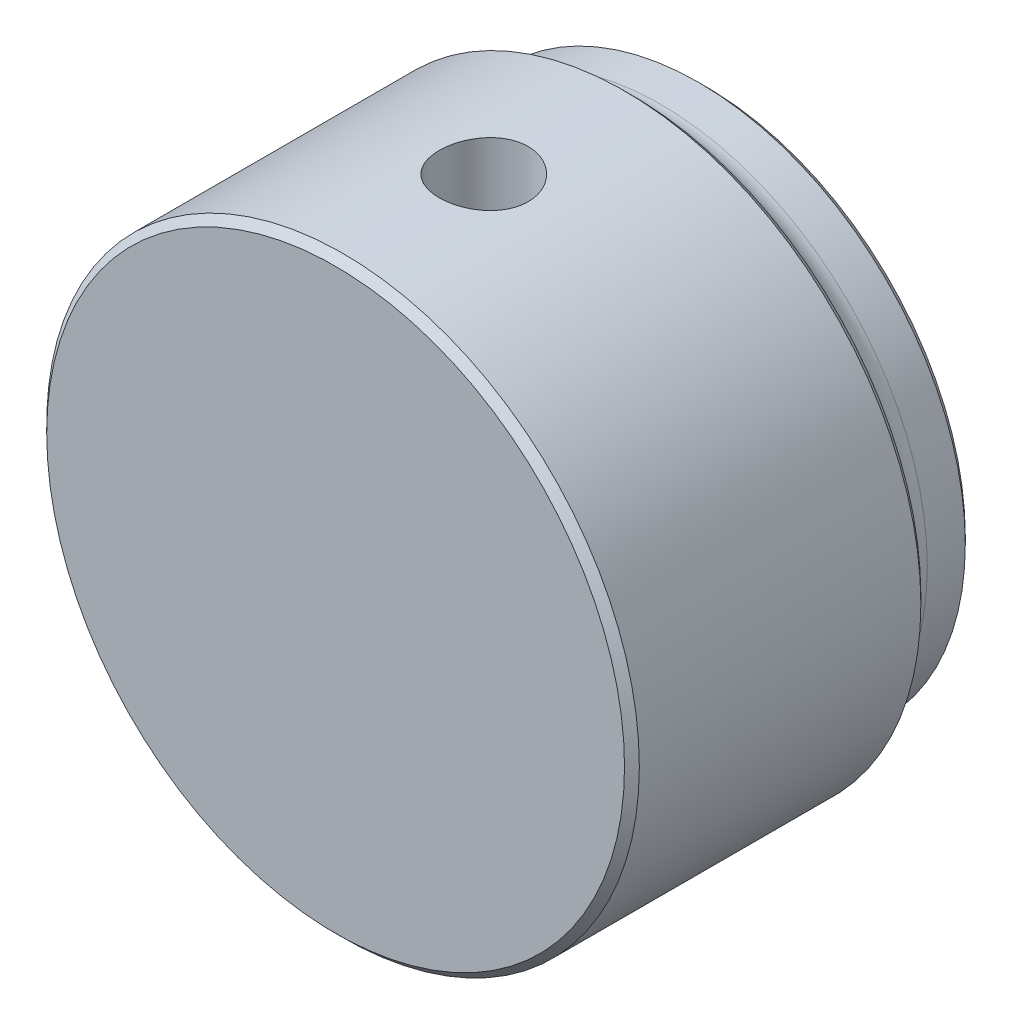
ISO-10303-21;
HEADER;
FILE_DESCRIPTION(('STEP AP214'),'2;1');
FILE_NAME('part.step','',(''),(''),'','','');
FILE_SCHEMA(('AUTOMOTIVE_DESIGN { 1 0 10303 214 1 1 1 1 }'));
ENDSEC;
DATA;
#1=APPLICATION_CONTEXT('core data for automotive mechanical design processes');
#2=APPLICATION_PROTOCOL_DEFINITION('international standard','automotive_design',2000,#1);
#3=PRODUCT_CONTEXT('',#1,'mechanical');
#4=PRODUCT('Part','Part','',(#3));
#5=PRODUCT_RELATED_PRODUCT_CATEGORY('part','',(#4));
#6=PRODUCT_DEFINITION_FORMATION('','',#4);
#7=PRODUCT_DEFINITION_CONTEXT('part definition',#1,'design');
#8=PRODUCT_DEFINITION('design','',#6,#7);
#9=PRODUCT_DEFINITION_SHAPE('','',#8);
#10=(LENGTH_UNIT() NAMED_UNIT(*) SI_UNIT(.MILLI.,.METRE.));
#11=(NAMED_UNIT(*) PLANE_ANGLE_UNIT() SI_UNIT($,.RADIAN.));
#12=(NAMED_UNIT(*) SI_UNIT($,.STERADIAN.) SOLID_ANGLE_UNIT());
#13=UNCERTAINTY_MEASURE_WITH_UNIT(LENGTH_MEASURE(1.E-05),#10,'distance_accuracy_value','');
#14=(GEOMETRIC_REPRESENTATION_CONTEXT(3) GLOBAL_UNCERTAINTY_ASSIGNED_CONTEXT((#13)) GLOBAL_UNIT_ASSIGNED_CONTEXT((#10,
#11,#12)) REPRESENTATION_CONTEXT('',''));
#15=CARTESIAN_POINT('',(0.,0.,0.));
#16=DIRECTION('',(0.,0.,1.));
#17=DIRECTION('',(1.,0.,0.));
#18=AXIS2_PLACEMENT_3D('',#15,#16,#17);
#19=CARTESIAN_POINT('',(0.,6.59194920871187E-13,50.8));
#20=DIRECTION('',(0.,0.,-1.));
#21=DIRECTION('',(-1.,0.,0.));
#22=AXIS2_PLACEMENT_3D('',#19,#20,#21);
#23=CYLINDRICAL_SURFACE('',#22,50.8);
#24=CARTESIAN_POINT('',(0.,-50.7999999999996,33.0199999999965));
#25=CARTESIAN_POINT('',(0.212802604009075,-50.8000011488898,33.0200029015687));
#26=CARTESIAN_POINT('',(0.425564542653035,-50.7986602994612,33.0110826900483));
#27=CARTESIAN_POINT('',(0.849629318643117,-50.7933368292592,32.9754732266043));
#28=CARTESIAN_POINT('',(1.06093183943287,-50.7893536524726,32.9487802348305));
#29=CARTESIAN_POINT('',(1.48063776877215,-50.7788521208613,32.8777970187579));
#30=CARTESIAN_POINT('',(1.68903910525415,-50.7723320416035,32.8334948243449));
#31=CARTESIAN_POINT('',(2.10139753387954,-50.7569375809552,32.7276091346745));
#32=CARTESIAN_POINT('',(2.30535296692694,-50.7480623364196,32.6660193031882));
#33=CARTESIAN_POINT('',(2.70707306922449,-50.7282185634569,32.5261030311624));
#34=CARTESIAN_POINT('',(2.90484449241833,-50.7172524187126,32.4477956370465));
#35=CARTESIAN_POINT('',(3.29313395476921,-50.6935214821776,32.2749434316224));
#36=CARTESIAN_POINT('',(3.48364928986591,-50.6807560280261,32.1803926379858));
#37=CARTESIAN_POINT('',(3.85593885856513,-50.6537911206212,31.9758061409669));
#38=CARTESIAN_POINT('',(4.0377175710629,-50.6395924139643,31.8657784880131));
#39=CARTESIAN_POINT('',(4.39146308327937,-50.6101429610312,31.6309342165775));
#40=CARTESIAN_POINT('',(4.563426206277,-50.5948918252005,31.5061121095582));
#41=CARTESIAN_POINT('',(4.89740038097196,-50.5636607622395,31.2417061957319));
#42=CARTESIAN_POINT('',(5.0593380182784,-50.5476766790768,31.1020301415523));
#43=CARTESIAN_POINT('',(5.37095361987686,-50.5155165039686,30.8095231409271));
#44=CARTESIAN_POINT('',(5.52062702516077,-50.4993403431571,30.6566873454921));
#45=CARTESIAN_POINT('',(5.80659328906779,-50.4672584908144,30.3389823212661));
#46=CARTESIAN_POINT('',(5.94288791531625,-50.4513527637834,30.1741146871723));
#47=CARTESIAN_POINT('',(6.2011696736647,-50.4202580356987,29.8334618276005));
#48=CARTESIAN_POINT('',(6.32315660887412,-50.40506904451,29.6576764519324));
#49=CARTESIAN_POINT('',(6.55252243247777,-50.3757668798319,29.295512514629));
#50=CARTESIAN_POINT('',(6.65982643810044,-50.3616593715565,29.1090860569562));
#51=CARTESIAN_POINT('',(6.85833669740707,-50.3350102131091,28.7277360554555));
#52=CARTESIAN_POINT('',(6.9495425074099,-50.3224686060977,28.5328122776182));
#53=CARTESIAN_POINT('',(7.11516001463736,-50.2993190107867,28.1358965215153));
#54=CARTESIAN_POINT('',(7.18957556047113,-50.2887105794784,27.9339061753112));
#55=CARTESIAN_POINT('',(7.32110212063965,-50.2697313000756,27.5241871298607));
#56=CARTESIAN_POINT('',(7.3782071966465,-50.2613612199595,27.3164564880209));
#57=CARTESIAN_POINT('',(7.47427136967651,-50.2471651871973,26.8984348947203));
#58=CARTESIAN_POINT('',(7.51336624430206,-50.241320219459,26.6881757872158));
#59=CARTESIAN_POINT('',(7.57375361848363,-50.2322524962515,26.2650576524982));
#60=CARTESIAN_POINT('',(7.5950459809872,-50.2290297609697,26.0521986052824));
#61=CARTESIAN_POINT('',(7.61966268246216,-50.2253013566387,25.625434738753));
#62=CARTESIAN_POINT('',(7.62298824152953,-50.2247955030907,25.4115299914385));
#63=CARTESIAN_POINT('',(7.61164893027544,-50.2265152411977,24.98420494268));
#64=CARTESIAN_POINT('',(7.59698374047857,-50.2287408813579,24.7707846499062));
#65=CARTESIAN_POINT('',(7.54997571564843,-50.2358280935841,24.3477806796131));
#66=CARTESIAN_POINT('',(7.51778404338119,-50.2406671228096,24.1381798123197));
#67=CARTESIAN_POINT('',(7.43605660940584,-50.2528284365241,23.7223900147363));
#68=CARTESIAN_POINT('',(7.38651490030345,-50.2601515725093,23.5162022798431));
#69=CARTESIAN_POINT('',(7.27046691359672,-50.2770698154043,23.1088145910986));
#70=CARTESIAN_POINT('',(7.20396637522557,-50.2866641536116,22.9076129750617));
#71=CARTESIAN_POINT('',(7.05449582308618,-50.3078498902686,22.511508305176));
#72=CARTESIAN_POINT('',(6.97151969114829,-50.319442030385,22.3166076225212));
#73=CARTESIAN_POINT('',(6.6980451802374,-50.3568298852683,21.7420594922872));
#74=CARTESIAN_POINT('',(6.48333803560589,-50.3851852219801,21.3737466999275));
#75=CARTESIAN_POINT('',(5.99592211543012,-50.4455048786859,20.6783583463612));
#76=CARTESIAN_POINT('',(5.72320953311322,-50.4774694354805,20.3512854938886));
#77=CARTESIAN_POINT('',(5.12417646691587,-50.5418070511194,19.7439570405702));
#78=CARTESIAN_POINT('',(4.79734706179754,-50.5741809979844,19.4642024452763));
#79=CARTESIAN_POINT('',(4.10111834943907,-50.6353902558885,18.963452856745));
#80=CARTESIAN_POINT('',(3.73171885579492,-50.6642255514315,18.7424581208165));
#81=CARTESIAN_POINT('',(2.96039380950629,-50.7151393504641,18.3654555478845));
#82=CARTESIAN_POINT('',(2.5584490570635,-50.7372138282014,18.2094864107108));
#83=CARTESIAN_POINT('',(1.73366763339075,-50.7720849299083,17.9674039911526));
#84=CARTESIAN_POINT('',(1.31083237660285,-50.784882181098,17.8812859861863));
#85=CARTESIAN_POINT('',(0.460601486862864,-50.799673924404,17.782015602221));
#86=CARTESIAN_POINT('',(0.033288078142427,-50.8017705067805,17.7681736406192));
#87=CARTESIAN_POINT('',(-0.817558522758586,-50.7952024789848,17.8120195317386));
#88=CARTESIAN_POINT('',(-1.24109183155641,-50.7865382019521,17.8697051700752));
#89=CARTESIAN_POINT('',(-2.07026381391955,-50.759485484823,18.0543905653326));
#90=CARTESIAN_POINT('',(-2.47597900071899,-50.7411441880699,18.1810543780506));
#91=CARTESIAN_POINT('',(-3.26042264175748,-50.6967860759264,18.4997637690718));
#92=CARTESIAN_POINT('',(-3.63914982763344,-50.6707689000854,18.691812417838));
#93=CARTESIAN_POINT('',(-4.36185572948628,-50.6137013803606,19.1373926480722));
#94=CARTESIAN_POINT('',(-4.70556165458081,-50.5826158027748,19.3913612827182));
#95=CARTESIAN_POINT('',(-5.34584157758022,-50.5189632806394,19.953207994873));
#96=CARTESIAN_POINT('',(-5.64241283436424,-50.4863962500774,20.2610892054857));
#97=CARTESIAN_POINT('',(-6.04661896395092,-50.4390433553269,20.7578966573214));
#98=CARTESIAN_POINT('',(-6.1750783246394,-50.4234399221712,20.9302108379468));
#99=CARTESIAN_POINT('',(-6.41701721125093,-50.3932210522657,21.2851091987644));
#100=CARTESIAN_POINT('',(-6.53050225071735,-50.3786052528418,21.4676895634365));
#101=CARTESIAN_POINT('',(-6.74171125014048,-50.350776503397,21.8419200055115));
#102=CARTESIAN_POINT('',(-6.8394297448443,-50.3375640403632,22.0335731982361));
#103=CARTESIAN_POINT('',(-7.01832473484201,-50.3129334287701,22.4244838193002));
#104=CARTESIAN_POINT('',(-7.09950714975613,-50.3015146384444,22.6237384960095));
#105=CARTESIAN_POINT('',(-7.2445197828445,-50.2808341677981,23.0278159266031));
#106=CARTESIAN_POINT('',(-7.30840738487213,-50.2715653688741,23.2326177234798));
#107=CARTESIAN_POINT('',(-7.41870741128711,-50.2554065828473,23.6469626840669));
#108=CARTESIAN_POINT('',(-7.46512024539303,-50.2485165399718,23.8565057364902));
#109=CARTESIAN_POINT('',(-7.5401156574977,-50.2373177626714,24.2788187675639));
#110=CARTESIAN_POINT('',(-7.56869893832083,-50.233008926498,24.4915886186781));
#111=CARTESIAN_POINT('',(-7.60781650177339,-50.2270994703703,24.9188146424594));
#112=CARTESIAN_POINT('',(-7.61835119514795,-50.2254987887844,25.1332707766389));
#113=CARTESIAN_POINT('',(-7.62127653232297,-50.2250549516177,25.5601871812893));
#114=CARTESIAN_POINT('',(-7.61384552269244,-50.2261846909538,25.7726462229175));
#115=CARTESIAN_POINT('',(-7.58127347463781,-50.2311115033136,26.1960961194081));
#116=CARTESIAN_POINT('',(-7.55613866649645,-50.2349076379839,26.4070874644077));
#117=CARTESIAN_POINT('',(-7.48835044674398,-50.245057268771,26.8262122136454));
#118=CARTESIAN_POINT('',(-7.44569390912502,-50.2514112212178,27.0343451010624));
#119=CARTESIAN_POINT('',(-7.34318383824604,-50.2664931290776,27.4462384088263));
#120=CARTESIAN_POINT('',(-7.28333065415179,-50.275221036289,27.6499989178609));
#121=CARTESIAN_POINT('',(-7.14692224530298,-50.294793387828,28.0515723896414));
#122=CARTESIAN_POINT('',(-7.07037965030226,-50.3056362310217,28.2493897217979));
#123=CARTESIAN_POINT('',(-6.90112404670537,-50.3291345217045,28.6378661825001));
#124=CARTESIAN_POINT('',(-6.808411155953,-50.3417899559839,28.8285253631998));
#125=CARTESIAN_POINT('',(-6.60745654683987,-50.3685595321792,29.2014188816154));
#126=CARTESIAN_POINT('',(-6.49921163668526,-50.3826739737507,29.3836514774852));
#127=CARTESIAN_POINT('',(-6.26800941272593,-50.4119591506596,29.7383474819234));
#128=CARTESIAN_POINT('',(-6.1450573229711,-50.427129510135,29.910814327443));
#129=CARTESIAN_POINT('',(-5.88396012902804,-50.4582645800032,30.2465540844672));
#130=CARTESIAN_POINT('',(-5.74567547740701,-50.4742357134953,30.4097178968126));
#131=CARTESIAN_POINT('',(-5.45594902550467,-50.5063743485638,30.7237814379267));
#132=CARTESIAN_POINT('',(-5.30451197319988,-50.52254177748,30.8746855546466));
#133=CARTESIAN_POINT('',(-4.98938852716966,-50.5546347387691,31.1633397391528));
#134=CARTESIAN_POINT('',(-4.82569484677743,-50.5705601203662,31.3010818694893));
#135=CARTESIAN_POINT('',(-4.48732930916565,-50.6017067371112,31.562299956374));
#136=CARTESIAN_POINT('',(-4.31266152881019,-50.6169282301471,31.6857811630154));
#137=CARTESIAN_POINT('',(-3.95243779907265,-50.6463332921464,31.9183484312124));
#138=CARTESIAN_POINT('',(-3.76682375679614,-50.660510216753,32.0273453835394));
#139=CARTESIAN_POINT('',(-3.38702550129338,-50.6873187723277,32.2292530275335));
#140=CARTESIAN_POINT('',(-3.19284447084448,-50.6999509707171,32.3221696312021));
#141=CARTESIAN_POINT('',(-2.79736008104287,-50.7233079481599,32.491218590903));
#142=CARTESIAN_POINT('',(-2.59606205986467,-50.7340341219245,32.5673632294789));
#143=CARTESIAN_POINT('',(-2.18771873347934,-50.7532825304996,32.7023652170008));
#144=CARTESIAN_POINT('',(-1.98067472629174,-50.7618052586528,32.7612264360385));
#145=CARTESIAN_POINT('',(-1.48178638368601,-50.7792098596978,32.8804636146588));
#146=CARTESIAN_POINT('',(-1.18792642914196,-50.7869714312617,32.9327313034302));
#147=CARTESIAN_POINT('',(-0.596017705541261,-50.7973656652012,33.0024972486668));
#148=CARTESIAN_POINT('',(-0.297968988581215,-50.7999983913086,33.0199959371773));
#149=CARTESIAN_POINT('',(0.,-50.7999999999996,33.0199999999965));
#150=B_SPLINE_CURVE_WITH_KNOTS('',3,(#24,#25,#26,#27,#28,#29,#30,#31,#32,#33,#34,#35,#36,#37,
#38,#39,#40,#41,#42,#43,#44,#45,#46,#47,#48,#49,#50,#51,#52,#53,#54,#55,#56,#57,#58,#59,#60,#61,
#62,#63,#64,#65,#66,#67,#68,#69,#70,#71,#72,#73,#74,#75,#76,#77,#78,#79,#80,#81,#82,#83,#84,#85,
#86,#87,#88,#89,#90,#91,#92,#93,#94,#95,#96,#97,#98,#99,#100,#101,#102,#103,#104,#105,#106,#107,
#108,#109,#110,#111,#112,#113,#114,#115,#116,#117,#118,#119,#120,#121,#122,#123,#124,#125,#126,
#127,#128,#129,#130,#131,#132,#133,#134,#135,#136,#137,#138,#139,#140,#141,#142,#143,#144,#145,
#146,#147,#148,#149),.UNSPECIFIED.,.T.,.F.,(4,2,2,2,2,2,2,2,2,2,2,2,2,2,2,2,2,2,2,2,2,2,2,2,2,2,
2,2,2,2,2,2,2,2,2,2,2,2,2,2,2,2,2,2,2,2,2,2,2,2,2,2,2,2,2,2,2,2,2,2,2,2,4),(0.,
0.638146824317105,1.27642797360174,1.91514374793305,2.55409392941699,3.19231999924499,
3.83078162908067,4.4689123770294,5.10728060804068,5.74987460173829,6.39270639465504,
7.03545314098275,7.67820873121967,8.32412904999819,8.97006716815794,9.61585707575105,
10.2618682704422,10.9029261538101,11.5439889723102,12.1850082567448,12.8260389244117,
13.4616264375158,14.0974320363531,14.7330227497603,15.3688499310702,16.6441456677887,
17.9195251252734,19.2076613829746,20.4958032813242,21.7847107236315,23.0735310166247,
24.350031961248,25.6264933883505,26.89679295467,28.1671521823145,29.4467517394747,
30.7264256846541,31.3722744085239,32.0178846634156,32.6637182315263,33.3093201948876,
33.9527530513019,34.5961708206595,35.239563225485,35.8829409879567,36.5199581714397,
37.1567512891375,37.793658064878,38.4305519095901,39.0669654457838,39.7033743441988,
40.3399142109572,40.9762286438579,41.6189018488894,42.2613440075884,42.9041711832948,
43.5467609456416,44.1931371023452,44.8392751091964,45.4849383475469,46.1304568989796,
47.0240095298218,47.9175510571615),.UNSPECIFIED.);
#151=CARTESIAN_POINT('',(0.,-50.7999999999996,33.0199999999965));
#152=VERTEX_POINT('',#151);
#153=EDGE_CURVE('E79',#152,#152,#150,.T.);
#154=ORIENTED_EDGE('',*,*,#153,.T.);
#155=EDGE_LOOP('',(#154));
#156=FACE_BOUND('',#155,.T.);
#157=CARTESIAN_POINT('',(0.,50.8,33.0199999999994));
#158=CARTESIAN_POINT('',(-0.212802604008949,50.8000011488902,33.0200029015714));
#159=CARTESIAN_POINT('',(-0.425564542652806,50.798660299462,33.0110826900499));
#160=CARTESIAN_POINT('',(-0.849629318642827,50.7933368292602,32.9754732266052));
#161=CARTESIAN_POINT('',(-1.06093183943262,50.7893536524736,32.9487802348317));
#162=CARTESIAN_POINT('',(-1.48063776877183,50.7788521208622,32.8777970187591));
#163=CARTESIAN_POINT('',(-1.68903910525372,50.7723320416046,32.8334948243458));
#164=CARTESIAN_POINT('',(-2.10139753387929,50.7569375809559,32.7276091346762));
#165=CARTESIAN_POINT('',(-2.30535296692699,50.74806233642,32.666019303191));
#166=CARTESIAN_POINT('',(-2.70707306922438,50.7282185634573,32.5261030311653));
#167=CARTESIAN_POINT('',(-2.90484449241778,50.7172524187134,32.4477956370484));
#168=CARTESIAN_POINT('',(-3.29313395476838,50.6935214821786,32.2749434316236));
#169=CARTESIAN_POINT('',(-3.48364928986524,50.6807560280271,32.1803926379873));
#170=CARTESIAN_POINT('',(-3.85593885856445,50.6537911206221,31.9758061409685));
#171=CARTESIAN_POINT('',(-4.03771757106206,50.6395924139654,31.8657784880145));
#172=CARTESIAN_POINT('',(-4.39146308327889,50.610142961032,31.6309342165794));
#173=CARTESIAN_POINT('',(-4.56342620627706,50.5948918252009,31.5061121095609));
#174=CARTESIAN_POINT('',(-4.89740038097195,50.5636607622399,31.2417061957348));
#175=CARTESIAN_POINT('',(-5.05933801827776,50.5476766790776,31.1020301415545));
#176=CARTESIAN_POINT('',(-5.37095361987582,50.5155165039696,30.8095231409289));
#177=CARTESIAN_POINT('',(-5.52062702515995,50.499340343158,30.6566873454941));
#178=CARTESIAN_POINT('',(-5.806593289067,50.4672584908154,30.3389823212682));
#179=CARTESIAN_POINT('',(-5.94288791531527,50.4513527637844,30.1741146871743));
#180=CARTESIAN_POINT('',(-6.20116967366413,50.4202580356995,29.8334618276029));
#181=CARTESIAN_POINT('',(-6.32315660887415,50.4050690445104,29.6576764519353));
#182=CARTESIAN_POINT('',(-6.55252243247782,50.3757668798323,29.2955125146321));
#183=CARTESIAN_POINT('',(-6.65982643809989,50.3616593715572,29.1090860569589));
#184=CARTESIAN_POINT('',(-6.85833669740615,50.3350102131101,28.727736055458));
#185=CARTESIAN_POINT('',(-6.94954250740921,50.3224686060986,28.5328122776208));
#186=CARTESIAN_POINT('',(-7.11516001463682,50.2993190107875,28.135896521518));
#187=CARTESIAN_POINT('',(-7.1895755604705,50.2887105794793,27.9339061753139));
#188=CARTESIAN_POINT('',(-7.32110212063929,50.2697313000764,27.5241871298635));
#189=CARTESIAN_POINT('',(-7.37820719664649,50.2613612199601,27.3164564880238));
#190=CARTESIAN_POINT('',(-7.47427136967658,50.2471651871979,26.8984348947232));
#191=CARTESIAN_POINT('',(-7.51336624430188,50.2413202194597,26.6881757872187));
#192=CARTESIAN_POINT('',(-7.57375361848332,50.2322524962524,26.2650576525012));
#193=CARTESIAN_POINT('',(-7.595045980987,50.2290297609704,26.0521986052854));
#194=CARTESIAN_POINT('',(-7.61966268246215,50.2253013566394,25.625434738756));
#195=CARTESIAN_POINT('',(-7.62298824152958,50.2247955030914,25.4115299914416));
#196=CARTESIAN_POINT('',(-7.61164893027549,50.2265152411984,24.9842049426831));
#197=CARTESIAN_POINT('',(-7.59698374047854,50.2287408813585,24.7707846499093));
#198=CARTESIAN_POINT('',(-7.54997571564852,50.2358280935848,24.3477806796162));
#199=CARTESIAN_POINT('',(-7.51778404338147,50.2406671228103,24.1381798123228));
#200=CARTESIAN_POINT('',(-7.43605660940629,50.2528284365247,23.7223900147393));
#201=CARTESIAN_POINT('',(-7.38651490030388,50.2601515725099,23.5162022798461));
#202=CARTESIAN_POINT('',(-7.2704669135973,50.2770698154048,23.1088145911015));
#203=CARTESIAN_POINT('',(-7.20396637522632,50.2866641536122,22.9076129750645));
#204=CARTESIAN_POINT('',(-7.05449582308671,50.3078498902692,22.5115083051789));
#205=CARTESIAN_POINT('',(-6.97151969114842,50.3194420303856,22.3166076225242));
#206=CARTESIAN_POINT('',(-6.69804518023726,50.3568298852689,21.7420594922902));
#207=CARTESIAN_POINT('',(-6.48333803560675,50.3851852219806,21.3737466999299));
#208=CARTESIAN_POINT('',(-5.99592211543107,50.4455048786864,20.6783583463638));
#209=CARTESIAN_POINT('',(-5.72320953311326,50.4774694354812,20.3512854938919));
#210=CARTESIAN_POINT('',(-5.12417646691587,50.54180705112,19.7439570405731));
#211=CARTESIAN_POINT('',(-4.79734706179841,50.5741809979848,19.4642024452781));
#212=CARTESIAN_POINT('',(-4.10111834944,50.6353902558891,18.9634528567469));
#213=CARTESIAN_POINT('',(-3.73171885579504,50.6642255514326,18.7424581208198));
#214=CARTESIAN_POINT('',(-2.96039380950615,50.7151393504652,18.3654555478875));
#215=CARTESIAN_POINT('',(-2.55844905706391,50.7372138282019,18.2094864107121));
#216=CARTESIAN_POINT('',(-1.73366763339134,50.7720849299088,17.967403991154));
#217=CARTESIAN_POINT('',(-1.31083237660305,50.7848821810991,17.8812859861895));
#218=CARTESIAN_POINT('',(-0.460601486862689,50.7996739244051,17.782015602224));
#219=CARTESIAN_POINT('',(-0.0332880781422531,50.8017705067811,17.7681736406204));
#220=CARTESIAN_POINT('',(0.817558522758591,50.7952024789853,17.8120195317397));
#221=CARTESIAN_POINT('',(1.24109183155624,50.7865382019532,17.8697051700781));
#222=CARTESIAN_POINT('',(2.07026381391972,50.759485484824,18.0543905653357));
#223=CARTESIAN_POINT('',(2.47597900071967,50.7411441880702,18.181054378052));
#224=CARTESIAN_POINT('',(3.260422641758,50.6967860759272,18.4997637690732));
#225=CARTESIAN_POINT('',(3.6391498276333,50.6707689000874,18.691812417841));
#226=CARTESIAN_POINT('',(4.36185572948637,50.6137013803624,19.1373926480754));
#227=CARTESIAN_POINT('',(4.70556165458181,50.5826158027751,19.3913612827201));
#228=CARTESIAN_POINT('',(5.34584157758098,50.5189632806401,19.953207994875));
#229=CARTESIAN_POINT('',(5.64241283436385,50.4863962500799,20.2610892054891));
#230=CARTESIAN_POINT('',(6.04661896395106,50.4390433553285,20.7578966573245));
#231=CARTESIAN_POINT('',(6.17507832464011,50.423439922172,20.9302108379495));
#232=CARTESIAN_POINT('',(6.41701721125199,50.3932210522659,21.2851091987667));
#233=CARTESIAN_POINT('',(6.53050225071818,50.3786052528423,21.467689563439));
#234=CARTESIAN_POINT('',(6.74171125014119,50.3507765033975,21.8419200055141));
#235=CARTESIAN_POINT('',(6.83942974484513,50.3375640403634,22.0335731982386));
#236=CARTESIAN_POINT('',(7.01832473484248,50.312933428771,22.4244838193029));
#237=CARTESIAN_POINT('',(7.09950714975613,50.3015146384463,22.6237384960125));
#238=CARTESIAN_POINT('',(7.24451978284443,50.2808341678,23.0278159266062));
#239=CARTESIAN_POINT('',(7.30840738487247,50.2715653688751,23.2326177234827));
#240=CARTESIAN_POINT('',(7.41870741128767,50.2554065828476,23.6469626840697));
#241=CARTESIAN_POINT('',(7.46512024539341,50.2485165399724,23.8565057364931));
#242=CARTESIAN_POINT('',(7.54011565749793,50.237317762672,24.2788187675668));
#243=CARTESIAN_POINT('',(7.56869893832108,50.2330089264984,24.491588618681));
#244=CARTESIAN_POINT('',(7.60781650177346,50.2270994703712,24.9188146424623));
#245=CARTESIAN_POINT('',(7.61835119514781,50.2254987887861,25.1332707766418));
#246=CARTESIAN_POINT('',(7.62127653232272,50.2250549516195,25.5601871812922));
#247=CARTESIAN_POINT('',(7.61384552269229,50.2261846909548,25.7726462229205));
#248=CARTESIAN_POINT('',(7.58127347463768,50.2311115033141,26.1960961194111));
#249=CARTESIAN_POINT('',(7.55613866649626,50.2349076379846,26.4070874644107));
#250=CARTESIAN_POINT('',(7.48835044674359,50.2450572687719,26.8262122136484));
#251=CARTESIAN_POINT('',(7.44569390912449,50.2514112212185,27.0343451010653));
#252=CARTESIAN_POINT('',(7.34318383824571,50.2664931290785,27.4462384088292));
#253=CARTESIAN_POINT('',(7.2833306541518,50.2752210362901,27.649998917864));
#254=CARTESIAN_POINT('',(7.14692224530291,50.2947933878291,28.0515723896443));
#255=CARTESIAN_POINT('',(7.07037965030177,50.3056362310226,28.2493897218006));
#256=CARTESIAN_POINT('',(6.90112404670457,50.3291345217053,28.6378661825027));
#257=CARTESIAN_POINT('',(6.80841115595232,50.3417899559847,28.8285253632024));
#258=CARTESIAN_POINT('',(6.60745654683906,50.3685595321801,29.2014188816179));
#259=CARTESIAN_POINT('',(6.49921163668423,50.3826739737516,29.3836514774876));
#260=CARTESIAN_POINT('',(6.26800941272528,50.4119591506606,29.738347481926));
#261=CARTESIAN_POINT('',(6.14505732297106,50.4271295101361,29.9108143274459));
#262=CARTESIAN_POINT('',(5.88396012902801,50.4582645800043,30.24655408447));
#263=CARTESIAN_POINT('',(5.74567547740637,50.4742357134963,30.4097178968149));
#264=CARTESIAN_POINT('',(5.45594902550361,50.5063743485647,30.7237814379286));
#265=CARTESIAN_POINT('',(5.30451197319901,50.5225417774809,30.8746855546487));
#266=CARTESIAN_POINT('',(4.98938852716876,50.5546347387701,31.1633397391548));
#267=CARTESIAN_POINT('',(4.8256948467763,50.5705601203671,31.301081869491));
#268=CARTESIAN_POINT('',(4.48732930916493,50.6017067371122,31.5622999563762));
#269=CARTESIAN_POINT('',(4.31266152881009,50.6169282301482,31.6857811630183));
#270=CARTESIAN_POINT('',(3.95243779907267,50.6463332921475,31.9183484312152));
#271=CARTESIAN_POINT('',(3.76682375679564,50.660510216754,32.0273453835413));
#272=CARTESIAN_POINT('',(3.38702550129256,50.6873187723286,32.2292530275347));
#273=CARTESIAN_POINT('',(3.19284447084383,50.6999509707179,32.3221696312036));
#274=CARTESIAN_POINT('',(2.79736008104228,50.7233079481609,32.4912185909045));
#275=CARTESIAN_POINT('',(2.59606205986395,50.7340341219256,32.5673632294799));
#276=CARTESIAN_POINT('',(2.18771873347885,50.7532825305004,32.7023652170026));
#277=CARTESIAN_POINT('',(1.98067472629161,50.7618052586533,32.7612264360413));
#278=CARTESIAN_POINT('',(1.48178638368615,50.7792098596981,32.8804636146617));
#279=CARTESIAN_POINT('',(1.18792642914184,50.7869714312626,32.9327313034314));
#280=CARTESIAN_POINT('',(0.596017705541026,50.7973656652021,33.002497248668));
#281=CARTESIAN_POINT('',(0.29796898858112,50.7999983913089,33.0199959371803));
#282=CARTESIAN_POINT('',(0.,50.8,33.0199999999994));
#283=B_SPLINE_CURVE_WITH_KNOTS('',3,(#157,#158,#159,#160,#161,#162,#163,#164,#165,#166,#167,
#168,#169,#170,#171,#172,#173,#174,#175,#176,#177,#178,#179,#180,#181,#182,#183,#184,#185,#186,
#187,#188,#189,#190,#191,#192,#193,#194,#195,#196,#197,#198,#199,#200,#201,#202,#203,#204,#205,
#206,#207,#208,#209,#210,#211,#212,#213,#214,#215,#216,#217,#218,#219,#220,#221,#222,#223,#224,
#225,#226,#227,#228,#229,#230,#231,#232,#233,#234,#235,#236,#237,#238,#239,#240,#241,#242,#243,
#244,#245,#246,#247,#248,#249,#250,#251,#252,#253,#254,#255,#256,#257,#258,#259,#260,#261,#262,
#263,#264,#265,#266,#267,#268,#269,#270,#271,#272,#273,#274,#275,#276,#277,#278,#279,#280,#281,
#282),.UNSPECIFIED.,.T.,.F.,(4,2,2,2,2,2,2,2,2,2,2,2,2,2,2,2,2,2,2,2,2,2,2,2,2,2,2,2,2,2,2,2,2,
2,2,2,2,2,2,2,2,2,2,2,2,2,2,2,2,2,2,2,2,2,2,2,2,2,2,2,2,2,4),(0.,0.638146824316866,
1.27642797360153,1.91514374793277,2.55409392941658,3.19231999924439,3.83078162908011,
4.46891237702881,5.10728060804,5.7498746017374,6.39270639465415,7.03545314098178,
7.67820873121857,8.32412904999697,8.97006716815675,9.61585707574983,10.2618682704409,
10.9029261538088,11.5439889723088,12.1850082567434,12.8260389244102,13.4616264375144,
14.0974320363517,14.7330227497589,15.3688499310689,16.6441456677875,17.9195251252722,
19.2076613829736,20.4958032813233,21.7847107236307,23.0735310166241,24.3500319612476,
25.6264933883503,26.8967929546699,28.1671521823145,29.4467517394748,30.7264256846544,
31.3722744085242,32.017884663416,32.6637182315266,33.309320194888,33.9527530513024,
34.5961708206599,35.2395632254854,35.8829409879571,36.5199581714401,37.156751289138,
37.7936580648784,38.4305519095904,39.0669654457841,39.703374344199,40.3399142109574,
40.9762286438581,41.6189018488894,42.2613440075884,42.9041711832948,43.5467609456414,
44.1931371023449,44.839275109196,45.4849383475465,46.1304568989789,47.0240095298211,
47.9175510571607),.UNSPECIFIED.);
#284=CARTESIAN_POINT('',(0.,50.8,33.0199999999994));
#285=VERTEX_POINT('',#284);
#286=EDGE_CURVE('E75',#285,#285,#283,.T.);
#287=ORIENTED_EDGE('',*,*,#286,.T.);
#288=EDGE_LOOP('',(#287));
#289=FACE_BOUND('',#288,.T.);
#290=CARTESIAN_POINT('',(0.,-2.67147415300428E-13,1.27000000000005));
#291=DIRECTION('',(0.,0.,1.));
#292=DIRECTION('',(1.,0.,0.));
#293=AXIS2_PLACEMENT_3D('',#290,#291,#292);
#294=CIRCLE('',#293,50.8);
#295=CARTESIAN_POINT('',(50.8,-3.01131482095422E-13,1.27000000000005));
#296=VERTEX_POINT('',#295);
#297=EDGE_CURVE('E51',#296,#296,#294,.T.);
#298=ORIENTED_EDGE('',*,*,#297,.T.);
#299=EDGE_LOOP('',(#298));
#300=FACE_BOUND('',#299,.T.);
#301=CARTESIAN_POINT('',(0.,6.73072708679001E-13,49.5299999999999));
#302=DIRECTION('',(0.,0.,1.));
#303=DIRECTION('',(1.,0.,0.));
#304=AXIS2_PLACEMENT_3D('',#301,#302,#303);
#305=CIRCLE('',#304,50.8);
#306=CARTESIAN_POINT('',(50.8,6.39088641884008E-13,49.5299999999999));
#307=VERTEX_POINT('',#306);
#308=EDGE_CURVE('E99',#307,#307,#305,.F.);
#309=ORIENTED_EDGE('',*,*,#308,.T.);
#310=EDGE_LOOP('',(#309));
#311=FACE_BOUND('',#310,.T.);
#312=ADVANCED_FACE('F34',(#156,#289,#300,#311),#23,.T.);
#313=CARTESIAN_POINT('',(0.,6.59194920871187E-13,50.8));
#314=DIRECTION('',(0.,0.,1.));
#315=DIRECTION('',(1.,0.,0.));
#316=AXIS2_PLACEMENT_3D('',#313,#314,#315);
#317=PLANE('',#316);
#318=CARTESIAN_POINT('',(0.,6.59194920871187E-13,50.8));
#319=DIRECTION('',(0.,0.,1.));
#320=DIRECTION('',(1.,0.,0.));
#321=AXIS2_PLACEMENT_3D('',#318,#319,#320);
#322=CIRCLE('',#321,49.53);
#323=CARTESIAN_POINT('',(49.53,6.26060455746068E-13,50.8));
#324=VERTEX_POINT('',#323);
#325=EDGE_CURVE('E92',#324,#324,#322,.T.);
#326=ORIENTED_EDGE('',*,*,#325,.T.);
#327=EDGE_LOOP('',(#326));
#328=FACE_BOUND('',#327,.T.);
#329=ADVANCED_FACE('F126',(#328),#317,.T.);
#330=CARTESIAN_POINT('',(0.,-4.26741975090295E-13,-12.7));
#331=DIRECTION('',(0.,0.,1.));
#332=DIRECTION('',(1.,0.,0.));
#333=AXIS2_PLACEMENT_3D('',#330,#331,#332);
#334=CYLINDRICAL_SURFACE('',#333,45.72);
#335=CARTESIAN_POINT('',(0.,1.04083408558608E-13,-4.91868884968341));
#336=DIRECTION('',(0.,0.,1.));
#337=DIRECTION('',(1.,0.,0.));
#338=AXIS2_PLACEMENT_3D('',#335,#336,#337);
#339=CIRCLE('',#338,45.72);
#340=CARTESIAN_POINT('',(45.72,0.,-4.91868884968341));
#341=VERTEX_POINT('',#340);
#342=EDGE_CURVE('E10',#341,#341,#339,.F.);
#343=ORIENTED_EDGE('',*,*,#342,.T.);
#344=EDGE_LOOP('',(#343));
#345=FACE_BOUND('',#344,.T.);
#346=CARTESIAN_POINT('',(0.,-4.47558656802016E-13,-11.43));
#347=DIRECTION('',(0.,0.,-1.));
#348=DIRECTION('',(-1.,0.,0.));
#349=AXIS2_PLACEMENT_3D('',#346,#347,#348);
#350=CIRCLE('',#349,45.72);
#351=CARTESIAN_POINT('',(-45.72,-4.16972996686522E-13,-11.43));
#352=VERTEX_POINT('',#351);
#353=EDGE_CURVE('E105',#352,#352,#350,.F.);
#354=ORIENTED_EDGE('',*,*,#353,.T.);
#355=EDGE_LOOP('',(#354));
#356=FACE_BOUND('',#355,.T.);
#357=ADVANCED_FACE('F131',(#345,#356),#334,.T.);
#358=CARTESIAN_POINT('',(0.,-4.26741975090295E-13,-12.7));
#359=DIRECTION('',(0.,0.,-1.));
#360=DIRECTION('',(-1.,0.,0.));
#361=AXIS2_PLACEMENT_3D('',#358,#359,#360);
#362=PLANE('',#361);
#363=CARTESIAN_POINT('',(0.,-4.26741975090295E-13,-12.7));
#364=DIRECTION('',(0.,0.,-1.));
#365=DIRECTION('',(-1.,0.,0.));
#366=AXIS2_PLACEMENT_3D('',#363,#364,#365);
#367=CIRCLE('',#366,44.45);
#368=CARTESIAN_POINT('',(-44.45,-3.97005916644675E-13,-12.7));
#369=VERTEX_POINT('',#368);
#370=EDGE_CURVE('E102',#369,#369,#367,.T.);
#371=ORIENTED_EDGE('',*,*,#370,.T.);
#372=EDGE_LOOP('',(#371));
#373=FACE_BOUND('',#372,.T.);
#374=CARTESIAN_POINT('',(0.,-4.26741975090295E-13,-12.7));
#375=DIRECTION('',(0.,0.,-1.));
#376=DIRECTION('',(-1.,0.,0.));
#377=AXIS2_PLACEMENT_3D('',#374,#375,#376);
#378=CIRCLE('',#377,30.48);
#379=CARTESIAN_POINT('',(-30.48,-4.06351535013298E-13,-12.7));
#380=VERTEX_POINT('',#379);
#381=EDGE_CURVE('E84',#380,#380,#378,.T.);
#382=ORIENTED_EDGE('',*,*,#381,.F.);
#383=EDGE_LOOP('',(#382));
#384=FACE_BOUND('',#383,.T.);
#385=ADVANCED_FACE('F154',(#373,#384),#362,.T.);
#386=CARTESIAN_POINT('',(0.,1.70002900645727E-13,15.2399999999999));
#387=DIRECTION('',(0.,0.,1.));
#388=DIRECTION('',(1.,0.,0.));
#389=AXIS2_PLACEMENT_3D('',#386,#387,#388);
#390=PLANE('',#389);
#391=CARTESIAN_POINT('',(0.,1.70002900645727E-13,15.2399999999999));
#392=DIRECTION('',(0.,0.,1.));
#393=DIRECTION('',(1.,0.,0.));
#394=AXIS2_PLACEMENT_3D('',#391,#392,#393);
#395=CIRCLE('',#394,35.56);
#396=CARTESIAN_POINT('',(35.56,1.46214053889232E-13,15.2399999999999));
#397=VERTEX_POINT('',#396);
#398=EDGE_CURVE('E85',#397,#397,#395,.T.);
#399=ORIENTED_EDGE('',*,*,#398,.T.);
#400=EDGE_LOOP('',(#399));
#401=FACE_BOUND('',#400,.T.);
#402=CARTESIAN_POINT('',(0.,1.70002900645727E-13,15.2399999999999));
#403=DIRECTION('',(0.,0.,1.));
#404=DIRECTION('',(1.,0.,0.));
#405=AXIS2_PLACEMENT_3D('',#402,#403,#404);
#406=CIRCLE('',#405,30.48);
#407=CARTESIAN_POINT('',(30.48,1.49612460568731E-13,15.2399999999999));
#408=VERTEX_POINT('',#407);
#409=EDGE_CURVE('E89',#408,#408,#406,.F.);
#410=ORIENTED_EDGE('',*,*,#409,.T.);
#411=EDGE_LOOP('',(#410));
#412=FACE_BOUND('',#411,.T.);
#413=ADVANCED_FACE('F146',(#401,#412),#390,.T.);
#414=CARTESIAN_POINT('',(0.,6.59194920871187E-13,50.8));
#415=DIRECTION('',(0.,0.,-1.));
#416=DIRECTION('',(-1.,0.,0.));
#417=AXIS2_PLACEMENT_3D('',#414,#415,#416);
#418=CYLINDRICAL_SURFACE('',#417,35.56);
#419=CARTESIAN_POINT('',(0.,-35.5599999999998,33.0200000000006));
#420=CARTESIAN_POINT('',(0.211489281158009,-35.5600025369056,33.0200047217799));
#421=CARTESIAN_POINT('',(0.422921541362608,-35.5581101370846,33.0111933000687));
#422=CARTESIAN_POINT('',(0.84431799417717,-35.5505989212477,32.9760284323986));
#423=CARTESIAN_POINT('',(1.05428195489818,-35.5449795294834,32.9496722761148));
#424=CARTESIAN_POINT('',(1.47125651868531,-35.5301641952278,32.8796076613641));
#425=CARTESIAN_POINT('',(1.67826571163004,-35.5209666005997,32.8358911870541));
#426=CARTESIAN_POINT('',(2.08784738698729,-35.4992473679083,32.7314373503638));
#427=CARTESIAN_POINT('',(2.29041820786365,-35.4867245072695,32.6706937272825));
#428=CARTESIAN_POINT('',(2.68934616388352,-35.4587217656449,32.5327623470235));
#429=CARTESIAN_POINT('',(2.88571166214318,-35.4432460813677,32.4555979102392));
#430=CARTESIAN_POINT('',(3.27126155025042,-35.4097431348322,32.2853231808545));
#431=CARTESIAN_POINT('',(3.46044325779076,-35.3917149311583,32.1922070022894));
#432=CARTESIAN_POINT('',(3.83020556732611,-35.3536088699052,31.9907687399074));
#433=CARTESIAN_POINT('',(4.01078980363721,-35.3335318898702,31.882453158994));
#434=CARTESIAN_POINT('',(4.36232461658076,-35.2918555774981,31.6513033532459));
#435=CARTESIAN_POINT('',(4.53327150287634,-35.2702556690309,31.5284636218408));
#436=CARTESIAN_POINT('',(4.86657169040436,-35.2258247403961,31.2673921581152));
#437=CARTESIAN_POINT('',(5.02877882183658,-35.2029810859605,31.1289759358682));
#438=CARTESIAN_POINT('',(5.34107408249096,-35.1569546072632,30.8390028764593));
#439=CARTESIAN_POINT('',(5.49115665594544,-35.1337716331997,30.6874400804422));
#440=CARTESIAN_POINT('',(5.77812775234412,-35.0877181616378,30.3722299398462));
#441=CARTESIAN_POINT('',(5.91501511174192,-35.0648476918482,30.2085815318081));
#442=CARTESIAN_POINT('',(6.17458765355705,-35.0200715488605,29.8703788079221));
#443=CARTESIAN_POINT('',(6.29727922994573,-34.9981654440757,29.6958294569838));
#444=CARTESIAN_POINT('',(6.52894525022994,-34.9556934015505,29.3349403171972));
#445=CARTESIAN_POINT('',(6.63775352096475,-34.9351449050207,29.1484917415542));
#446=CARTESIAN_POINT('',(6.8392053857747,-34.8962662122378,28.7669266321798));
#447=CARTESIAN_POINT('',(6.93185520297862,-34.8779351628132,28.5718134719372));
#448=CARTESIAN_POINT('',(7.10035760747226,-34.8440226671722,28.1741602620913));
#449=CARTESIAN_POINT('',(7.17620512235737,-34.8284420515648,27.9716179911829));
#450=CARTESIAN_POINT('',(7.31043682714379,-34.8005146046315,27.5606969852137));
#451=CARTESIAN_POINT('',(7.36882804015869,-34.7881664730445,27.3523206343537));
#452=CARTESIAN_POINT('',(7.46698642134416,-34.7672287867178,26.9342563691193));
#453=CARTESIAN_POINT('',(7.5070128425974,-34.7585870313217,26.7246319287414));
#454=CARTESIAN_POINT('',(7.56934249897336,-34.7450668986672,26.3027229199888));
#455=CARTESIAN_POINT('',(7.59165241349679,-34.7401871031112,26.0904393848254));
#456=CARTESIAN_POINT('',(7.6183887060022,-34.7343337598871,25.664677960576));
#457=CARTESIAN_POINT('',(7.62281363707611,-34.7333605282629,25.4511999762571));
#458=CARTESIAN_POINT('',(7.61373858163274,-34.7353509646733,25.0246449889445));
#459=CARTESIAN_POINT('',(7.60023877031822,-34.7383145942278,24.811567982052));
#460=CARTESIAN_POINT('',(7.55582425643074,-34.7480017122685,24.3911319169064));
#461=CARTESIAN_POINT('',(7.52522105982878,-34.7546579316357,24.1837383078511));
#462=CARTESIAN_POINT('',(7.44705856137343,-34.7714899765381,23.772242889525));
#463=CARTESIAN_POINT('',(7.39949339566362,-34.781667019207,23.568142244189));
#464=CARTESIAN_POINT('',(7.28779891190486,-34.8052415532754,23.164789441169));
#465=CARTESIAN_POINT('',(7.22367495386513,-34.8186380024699,22.9655357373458));
#466=CARTESIAN_POINT('',(7.07931544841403,-34.8482757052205,22.5730893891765));
#467=CARTESIAN_POINT('',(6.99907389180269,-34.8645180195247,22.379899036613));
#468=CARTESIAN_POINT('',(6.82243954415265,-34.8995140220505,21.9995582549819));
#469=CARTESIAN_POINT('',(6.72593311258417,-34.9182851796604,21.8124622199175));
#470=CARTESIAN_POINT('',(6.517841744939,-34.9577252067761,21.4469789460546));
#471=CARTESIAN_POINT('',(6.40625160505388,-34.9783947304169,21.2685947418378));
#472=CARTESIAN_POINT('',(6.16879942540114,-35.0210516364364,20.9217774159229));
#473=CARTESIAN_POINT('',(6.04293826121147,-35.0430389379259,20.7533436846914));
#474=CARTESIAN_POINT('',(5.77778483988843,-35.0877310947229,20.4275032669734));
#475=CARTESIAN_POINT('',(5.6384923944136,-35.1104359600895,20.2700967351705));
#476=CARTESIAN_POINT('',(5.3443437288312,-35.1564247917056,19.9641600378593));
#477=CARTESIAN_POINT('',(5.18922278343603,-35.1797109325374,19.8158846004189));
#478=CARTESIAN_POINT('',(4.86704090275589,-35.2257289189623,19.5329512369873));
#479=CARTESIAN_POINT('',(4.69998400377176,-35.2484609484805,19.3982887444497));
#480=CARTESIAN_POINT('',(4.35494068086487,-35.2927521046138,19.1434104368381));
#481=CARTESIAN_POINT('',(4.17695003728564,-35.3143107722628,19.0232002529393));
#482=CARTESIAN_POINT('',(3.81137496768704,-35.3556337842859,18.7981918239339));
#483=CARTESIAN_POINT('',(3.62379424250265,-35.3753988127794,18.6933876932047));
#484=CARTESIAN_POINT('',(3.23980691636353,-35.412632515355,18.4996810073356));
#485=CARTESIAN_POINT('',(3.04338034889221,-35.4300956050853,18.4108169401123));
#486=CARTESIAN_POINT('',(2.64357489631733,-35.4621673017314,18.2500126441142));
#487=CARTESIAN_POINT('',(2.44019861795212,-35.4767769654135,18.1780661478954));
#488=CARTESIAN_POINT('',(2.02787010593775,-35.5027324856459,18.0516228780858));
#489=CARTESIAN_POINT('',(1.81891746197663,-35.5140781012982,17.997127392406));
#490=CARTESIAN_POINT('',(1.39698457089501,-35.5331764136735,17.9060415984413));
#491=CARTESIAN_POINT('',(1.18400439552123,-35.5409291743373,17.8694509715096));
#492=CARTESIAN_POINT('',(0.759736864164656,-35.5525043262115,17.8150110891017));
#493=CARTESIAN_POINT('',(0.548496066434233,-35.5563996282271,17.7968140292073));
#494=CARTESIAN_POINT('',(0.125121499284,-35.5604101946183,17.7780804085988));
#495=CARTESIAN_POINT('',(-0.0870125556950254,-35.5605241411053,17.7775500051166));
#496=CARTESIAN_POINT('',(-0.51046355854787,-35.5569661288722,17.7941663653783));
#497=CARTESIAN_POINT('',(-0.721780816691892,-35.5532957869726,17.8113055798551));
#498=CARTESIAN_POINT('',(-1.14223637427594,-35.54227256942,17.863118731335));
#499=CARTESIAN_POINT('',(-1.35137383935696,-35.534918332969,17.8977991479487));
#500=CARTESIAN_POINT('',(-1.7636328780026,-35.5168313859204,17.9839456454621));
#501=CARTESIAN_POINT('',(-1.9667951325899,-35.5061362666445,18.0352251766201));
#502=CARTESIAN_POINT('',(-2.36810911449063,-35.4816303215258,18.1542921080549));
#503=CARTESIAN_POINT('',(-2.56625899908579,-35.4678183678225,18.2220854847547));
#504=CARTESIAN_POINT('',(-2.95609997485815,-35.4374561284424,18.3736492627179));
#505=CARTESIAN_POINT('',(-3.14779194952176,-35.4209062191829,18.4574174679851));
#506=CARTESIAN_POINT('',(-3.52347942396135,-35.3855097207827,18.6403294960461));
#507=CARTESIAN_POINT('',(-3.70747460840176,-35.3666630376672,18.7394739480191));
#508=CARTESIAN_POINT('',(-4.06903592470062,-35.3269030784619,18.9539058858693));
#509=CARTESIAN_POINT('',(-4.2464786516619,-35.3059649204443,19.0693968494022));
#510=CARTESIAN_POINT('',(-4.59104287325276,-35.2628143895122,19.3146531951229));
#511=CARTESIAN_POINT('',(-4.758164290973,-35.2406020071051,19.4444186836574));
#512=CARTESIAN_POINT('',(-5.08101055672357,-35.1955040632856,19.7173581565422));
#513=CARTESIAN_POINT('',(-5.23673402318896,-35.1726184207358,19.8605337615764));
#514=CARTESIAN_POINT('',(-5.53573742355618,-35.1268002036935,20.1593243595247));
#515=CARTESIAN_POINT('',(-5.67901752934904,-35.1038676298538,20.314939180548));
#516=CARTESIAN_POINT('',(-5.95462959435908,-35.0581780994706,20.6404750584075));
#517=CARTESIAN_POINT('',(-6.08672015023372,-35.0354316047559,20.8106020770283));
#518=CARTESIAN_POINT('',(-6.3360527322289,-34.9911998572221,21.1614698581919));
#519=CARTESIAN_POINT('',(-6.45330018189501,-34.9697141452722,21.3422067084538));
#520=CARTESIAN_POINT('',(-6.67219565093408,-34.9286102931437,21.7131848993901));
#521=CARTESIAN_POINT('',(-6.7738381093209,-34.908992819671,21.9034295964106));
#522=CARTESIAN_POINT('',(-6.96067502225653,-34.8722191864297,22.2919698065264));
#523=CARTESIAN_POINT('',(-7.04587595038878,-34.8550620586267,22.4902621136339));
#524=CARTESIAN_POINT('',(-7.19881685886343,-34.8237950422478,22.8925127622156));
#525=CARTESIAN_POINT('',(-7.26664571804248,-34.8096697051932,23.0964360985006));
#526=CARTESIAN_POINT('',(-7.38485841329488,-34.7847828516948,23.5093981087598));
#527=CARTESIAN_POINT('',(-7.43524881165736,-34.7740200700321,23.7184348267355));
#528=CARTESIAN_POINT('',(-7.51820832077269,-34.7561785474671,24.140184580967));
#529=CARTESIAN_POINT('',(-7.55077637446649,-34.7491000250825,24.3528978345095));
#530=CARTESIAN_POINT('',(-7.59781208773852,-34.7388461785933,24.7804085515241));
#531=CARTESIAN_POINT('',(-7.61228004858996,-34.7356707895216,24.9952059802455));
#532=CARTESIAN_POINT('',(-7.62288052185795,-34.7333459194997,25.420732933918));
#533=CARTESIAN_POINT('',(-7.61939362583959,-34.7341128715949,25.6314526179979));
#534=CARTESIAN_POINT('',(-7.59498375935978,-34.7394585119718,26.0519050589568));
#535=CARTESIAN_POINT('',(-7.57405474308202,-34.7440385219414,26.2616374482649));
#536=CARTESIAN_POINT('',(-7.51493442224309,-34.7568737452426,26.6784574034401));
#537=CARTESIAN_POINT('',(-7.47674969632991,-34.7651275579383,26.8855459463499));
#538=CARTESIAN_POINT('',(-7.3834079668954,-34.7850709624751,27.2957724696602));
#539=CARTESIAN_POINT('',(-7.32824466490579,-34.7967618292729,27.4989089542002));
#540=CARTESIAN_POINT('',(-7.20160831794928,-34.8231905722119,27.899022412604));
#541=CARTESIAN_POINT('',(-7.1301943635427,-34.8379173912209,28.0960188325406));
#542=CARTESIAN_POINT('',(-6.97145596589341,-34.8700294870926,28.4833460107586));
#543=CARTESIAN_POINT('',(-6.8841260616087,-34.8874156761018,28.6736744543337));
#544=CARTESIAN_POINT('',(-6.69421398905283,-34.9243532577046,29.0463169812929));
#545=CARTESIAN_POINT('',(-6.59163335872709,-34.9439044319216,29.2286318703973));
#546=CARTESIAN_POINT('',(-6.3719284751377,-34.9846338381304,29.584087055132));
#547=CARTESIAN_POINT('',(-6.25480392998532,-35.0058121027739,29.7572271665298));
#548=CARTESIAN_POINT('',(-6.0043695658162,-35.0496450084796,30.0965169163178));
#549=CARTESIAN_POINT('',(-5.87078741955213,-35.0723204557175,30.2624629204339));
#550=CARTESIAN_POINT('',(-5.59028638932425,-35.1181218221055,30.5825053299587));
#551=CARTESIAN_POINT('',(-5.44337187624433,-35.141247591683,30.7366055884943));
#552=CARTESIAN_POINT('',(-5.13706351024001,-35.1873297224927,31.0320765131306));
#553=CARTESIAN_POINT('',(-4.97766247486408,-35.2102859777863,31.173439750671));
#554=CARTESIAN_POINT('',(-4.64757666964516,-35.2553735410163,31.4423281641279));
#555=CARTESIAN_POINT('',(-4.4768960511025,-35.2775051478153,31.56985838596));
#556=CARTESIAN_POINT('',(-4.12308796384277,-35.3206157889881,31.8117902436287));
#557=CARTESIAN_POINT('',(-3.93982953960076,-35.3415765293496,31.9260037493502));
#558=CARTESIAN_POINT('',(-3.5641815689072,-35.381433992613,32.1385134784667));
#559=CARTESIAN_POINT('',(-3.37179541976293,-35.4003314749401,32.2368155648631));
#560=CARTESIAN_POINT('',(-2.97927399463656,-35.4355232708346,32.4167586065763));
#561=CARTESIAN_POINT('',(-2.77914313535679,-35.4518190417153,32.4984088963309));
#562=CARTESIAN_POINT('',(-2.37253361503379,-35.4813511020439,32.644457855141));
#563=CARTESIAN_POINT('',(-2.16605611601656,-35.4945879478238,32.708859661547));
#564=CARTESIAN_POINT('',(-1.63863026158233,-35.5236534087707,32.8490099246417));
#565=CARTESIAN_POINT('',(-1.31436214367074,-35.5372090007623,32.9130378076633));
#566=CARTESIAN_POINT('',(-0.660016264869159,-35.5553801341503,32.9985282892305));
#567=CARTESIAN_POINT('',(-0.329938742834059,-35.5599960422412,33.0199926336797));
#568=CARTESIAN_POINT('',(0.,-35.5599999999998,33.0200000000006));
#569=B_SPLINE_CURVE_WITH_KNOTS('',3,(#419,#420,#421,#422,#423,#424,#425,#426,#427,#428,#429,
#430,#431,#432,#433,#434,#435,#436,#437,#438,#439,#440,#441,#442,#443,#444,#445,#446,#447,#448,
#449,#450,#451,#452,#453,#454,#455,#456,#457,#458,#459,#460,#461,#462,#463,#464,#465,#466,#467,
#468,#469,#470,#471,#472,#473,#474,#475,#476,#477,#478,#479,#480,#481,#482,#483,#484,#485,#486,
#487,#488,#489,#490,#491,#492,#493,#494,#495,#496,#497,#498,#499,#500,#501,#502,#503,#504,#505,
#506,#507,#508,#509,#510,#511,#512,#513,#514,#515,#516,#517,#518,#519,#520,#521,#522,#523,#524,
#525,#526,#527,#528,#529,#530,#531,#532,#533,#534,#535,#536,#537,#538,#539,#540,#541,#542,#543,
#544,#545,#546,#547,#548,#549,#550,#551,#552,#553,#554,#555,#556,#557,#558,#559,#560,#561,#562,
#563,#564,#565,#566,#567,#568),.UNSPECIFIED.,.T.,.F.,(4,2,2,2,2,2,2,2,2,2,2,2,2,2,2,2,2,2,2,2,2,
2,2,2,2,2,2,2,2,2,2,2,2,2,2,2,2,2,2,2,2,2,2,2,2,2,2,2,2,2,2,2,2,2,2,2,2,2,2,2,2,2,2,2,2,2,2,2,2,
2,2,2,2,2,4),(0.,0.634177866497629,1.26845372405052,1.90302278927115,2.53782548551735,
3.17173259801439,3.80587411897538,4.43974515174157,5.07385728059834,5.71648193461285,
6.35939940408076,7.00237351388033,7.645056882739,8.29482695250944,8.94434622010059,
9.59406130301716,10.2435146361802,10.8834940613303,11.523232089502,12.1630218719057,
12.8028054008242,13.4312993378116,14.060010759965,14.6885189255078,15.3172618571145,
15.9505951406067,16.5841474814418,17.2176609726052,17.8511833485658,18.4979649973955,
19.1445289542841,19.7913440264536,20.4379113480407,21.0860194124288,21.7338869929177,
22.3818023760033,23.0297062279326,23.6651157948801,24.3007468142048,24.9361063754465,
25.5717008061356,26.2003866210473,26.8293002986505,27.4581275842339,28.086980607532,
28.7244923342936,29.3620088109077,29.9996024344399,30.6371872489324,31.2861659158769,
31.9349067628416,32.5838782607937,33.2325937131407,33.877920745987,34.5230046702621,
35.1681268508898,35.813238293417,36.4447322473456,37.0764451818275,37.7079174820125,
38.3396243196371,38.969069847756,39.5987317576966,40.2283302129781,40.8579413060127,
41.4998976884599,42.1416443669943,42.7837629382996,43.4256464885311,44.0757144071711,
44.7255422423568,45.3750047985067,46.0243491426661,47.0137535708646,48.0031174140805),.UNSPECIFIED.);
#570=CARTESIAN_POINT('',(0.,-35.5599999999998,33.0200000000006));
#571=VERTEX_POINT('',#570);
#572=EDGE_CURVE('E38',#571,#571,#569,.T.);
#573=ORIENTED_EDGE('',*,*,#572,.F.);
#574=EDGE_LOOP('',(#573));
#575=FACE_BOUND('',#574,.T.);
#576=CARTESIAN_POINT('',(0.,35.56,33.0199999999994));
#577=CARTESIAN_POINT('',(-0.211489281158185,35.5600025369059,33.0200047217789));
#578=CARTESIAN_POINT('',(-0.422921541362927,35.5581101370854,33.011193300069));
#579=CARTESIAN_POINT('',(-0.844317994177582,35.5505989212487,32.9760284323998));
#580=CARTESIAN_POINT('',(-1.05428195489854,35.5449795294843,32.9496722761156));
#581=CARTESIAN_POINT('',(-1.47125651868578,35.5301641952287,32.8796076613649));
#582=CARTESIAN_POINT('',(-1.67826571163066,35.5209666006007,32.8358911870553));
#583=CARTESIAN_POINT('',(-2.08784738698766,35.499247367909,32.731437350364));
#584=CARTESIAN_POINT('',(-2.29041820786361,35.4867245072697,32.6706937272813));
#585=CARTESIAN_POINT('',(-2.6893461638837,35.4587217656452,32.5327623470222));
#586=CARTESIAN_POINT('',(-2.88571166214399,35.4432460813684,32.4555979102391));
#587=CARTESIAN_POINT('',(-3.27126155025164,35.4097431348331,32.2853231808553));
#588=CARTESIAN_POINT('',(-3.46044325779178,35.391714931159,32.1922070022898));
#589=CARTESIAN_POINT('',(-3.83020556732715,35.353608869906,31.9907687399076));
#590=CARTESIAN_POINT('',(-4.01078980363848,35.3335318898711,31.8824531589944));
#591=CARTESIAN_POINT('',(-4.3623246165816,35.2918555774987,31.6513033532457));
#592=CARTESIAN_POINT('',(-4.5332715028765,35.2702556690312,31.5284636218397));
#593=CARTESIAN_POINT('',(-4.86657169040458,35.2258247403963,31.2673921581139));
#594=CARTESIAN_POINT('',(-5.02877882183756,35.2029810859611,31.1289759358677));
#595=CARTESIAN_POINT('',(-5.34107408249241,35.156954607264,30.8390028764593));
#596=CARTESIAN_POINT('',(-5.49115665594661,35.1337716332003,30.6874400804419));
#597=CARTESIAN_POINT('',(-5.77812775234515,35.0877181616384,30.3722299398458));
#598=CARTESIAN_POINT('',(-5.91501511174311,35.0648476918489,30.2085815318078));
#599=CARTESIAN_POINT('',(-6.17458765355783,35.0200715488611,29.8703788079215));
#600=CARTESIAN_POINT('',(-6.29727922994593,34.9981654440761,29.6958294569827));
#601=CARTESIAN_POINT('',(-6.5289452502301,34.9556934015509,29.334940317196));
#602=CARTESIAN_POINT('',(-6.63775352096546,34.9351449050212,29.1484917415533));
#603=CARTESIAN_POINT('',(-6.83920538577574,34.8962662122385,28.766926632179));
#604=CARTESIAN_POINT('',(-6.93185520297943,34.8779351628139,28.5718134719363));
#605=CARTESIAN_POINT('',(-7.10035760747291,34.8440226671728,28.1741602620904));
#606=CARTESIAN_POINT('',(-7.1762051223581,34.8284420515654,27.971617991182));
#607=CARTESIAN_POINT('',(-7.31043682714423,34.8005146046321,27.5606969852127));
#608=CARTESIAN_POINT('',(-7.36882804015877,34.7881664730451,27.3523206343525));
#609=CARTESIAN_POINT('',(-7.46698642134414,34.7672287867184,26.9342563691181));
#610=CARTESIAN_POINT('',(-7.50701284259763,34.7585870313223,26.7246319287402));
#611=CARTESIAN_POINT('',(-7.56934249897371,34.7450668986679,26.3027229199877));
#612=CARTESIAN_POINT('',(-7.59165241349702,34.740187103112,26.0904393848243));
#613=CARTESIAN_POINT('',(-7.61838870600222,34.7343337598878,25.6646779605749));
#614=CARTESIAN_POINT('',(-7.62281363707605,34.7333605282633,25.451199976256));
#615=CARTESIAN_POINT('',(-7.61373858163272,34.7353509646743,25.0246449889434));
#616=CARTESIAN_POINT('',(-7.60023877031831,34.7383145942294,24.8115679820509));
#617=CARTESIAN_POINT('',(-7.55582425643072,34.7480017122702,24.3911319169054));
#618=CARTESIAN_POINT('',(-7.52522105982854,34.7546579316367,24.1837383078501));
#619=CARTESIAN_POINT('',(-7.447058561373,34.7714899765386,23.7722428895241));
#620=CARTESIAN_POINT('',(-7.39949339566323,34.7816670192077,23.568142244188));
#621=CARTESIAN_POINT('',(-7.28779891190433,34.8052415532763,23.1647894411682));
#622=CARTESIAN_POINT('',(-7.22367495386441,34.8186380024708,22.9655357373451));
#623=CARTESIAN_POINT('',(-7.07931544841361,34.8482757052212,22.5730893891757));
#624=CARTESIAN_POINT('',(-6.99907389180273,34.8645180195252,22.3798990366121));
#625=CARTESIAN_POINT('',(-6.82243954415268,34.899514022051,21.9995582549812));
#626=CARTESIAN_POINT('',(-6.72593311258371,34.9182851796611,21.8124622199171));
#627=CARTESIAN_POINT('',(-6.51784174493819,34.9577252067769,21.4469789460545));
#628=CARTESIAN_POINT('',(-6.40625160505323,34.9783947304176,21.2685947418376));
#629=CARTESIAN_POINT('',(-6.16879942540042,35.0210516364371,20.9217774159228));
#630=CARTESIAN_POINT('',(-6.04293826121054,35.0430389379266,20.7533436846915));
#631=CARTESIAN_POINT('',(-5.77778483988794,35.0877310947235,20.4275032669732));
#632=CARTESIAN_POINT('',(-5.63849239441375,35.1104359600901,20.2700967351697));
#633=CARTESIAN_POINT('',(-5.34434372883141,35.1564247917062,19.9641600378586));
#634=CARTESIAN_POINT('',(-5.18922278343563,35.179710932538,19.8158846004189));
#635=CARTESIAN_POINT('',(-4.86704090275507,35.225728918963,19.5329512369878));
#636=CARTESIAN_POINT('',(-4.69998400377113,35.2484609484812,19.3982887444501));
#637=CARTESIAN_POINT('',(-4.35494068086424,35.2927521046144,19.1434104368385));
#638=CARTESIAN_POINT('',(-4.17695003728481,35.3143107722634,19.02320025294));
#639=CARTESIAN_POINT('',(-3.81137496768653,35.3556337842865,18.798191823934));
#640=CARTESIAN_POINT('',(-3.62379424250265,35.3753988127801,18.693387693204));
#641=CARTESIAN_POINT('',(-3.23980691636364,35.4126325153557,18.499681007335));
#642=CARTESIAN_POINT('',(-3.04338034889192,35.4300956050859,18.4108169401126));
#643=CARTESIAN_POINT('',(-2.64357489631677,35.4621673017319,18.2500126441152));
#644=CARTESIAN_POINT('',(-2.44019861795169,35.4767769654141,18.1780661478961));
#645=CARTESIAN_POINT('',(-2.02787010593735,35.5027324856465,18.0516228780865));
#646=CARTESIAN_POINT('',(-1.81891746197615,35.5140781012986,17.9971273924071));
#647=CARTESIAN_POINT('',(-1.39698457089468,35.5331764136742,17.9060415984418));
#648=CARTESIAN_POINT('',(-1.18400439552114,35.5409291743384,17.869450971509));
#649=CARTESIAN_POINT('',(-0.759736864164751,35.5525043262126,17.8150110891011));
#650=CARTESIAN_POINT('',(-0.548496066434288,35.5563996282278,17.7968140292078));
#651=CARTESIAN_POINT('',(-0.125121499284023,35.5604101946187,17.7780804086));
#652=CARTESIAN_POINT('',(0.0870125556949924,35.5605241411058,17.7775500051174));
#653=CARTESIAN_POINT('',(0.510463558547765,35.5569661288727,17.7941663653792));
#654=CARTESIAN_POINT('',(0.721780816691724,35.553295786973,17.8113055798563));
#655=CARTESIAN_POINT('',(1.14223637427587,35.5422725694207,17.8631187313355));
#656=CARTESIAN_POINT('',(1.35137383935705,35.5349183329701,17.8977991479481));
#657=CARTESIAN_POINT('',(1.76363287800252,35.5168313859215,17.9839456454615));
#658=CARTESIAN_POINT('',(1.9667951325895,35.5061362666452,18.0352251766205));
#659=CARTESIAN_POINT('',(2.36810911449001,35.4816303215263,18.1542921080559));
#660=CARTESIAN_POINT('',(2.56625899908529,35.4678183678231,18.2220854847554));
#661=CARTESIAN_POINT('',(2.9560999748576,35.437456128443,18.3736492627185));
#662=CARTESIAN_POINT('',(3.14779194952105,35.4209062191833,18.4574174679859));
#663=CARTESIAN_POINT('',(3.52347942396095,35.3855097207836,18.6403294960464));
#664=CARTESIAN_POINT('',(3.70747460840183,35.366663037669,18.7394739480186));
#665=CARTESIAN_POINT('',(4.06903592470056,35.3269030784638,18.9539058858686));
#666=CARTESIAN_POINT('',(4.24647865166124,35.3059649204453,19.0693968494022));
#667=CARTESIAN_POINT('',(4.59104287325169,35.2628143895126,19.3146531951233));
#668=CARTESIAN_POINT('',(4.75816429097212,35.2406020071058,19.4444186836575));
#669=CARTESIAN_POINT('',(5.08101055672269,35.1955040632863,19.7173581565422));
#670=CARTESIAN_POINT('',(5.23673402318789,35.1726184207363,19.8605337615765));
#671=CARTESIAN_POINT('',(5.53573742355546,35.1268002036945,20.1593243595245));
#672=CARTESIAN_POINT('',(5.67901752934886,35.1038676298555,20.3149391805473));
#673=CARTESIAN_POINT('',(5.9546295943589,35.0581780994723,20.6404750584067));
#674=CARTESIAN_POINT('',(6.08672015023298,35.0354316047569,20.8106020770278));
#675=CARTESIAN_POINT('',(6.33605273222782,34.9911998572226,21.1614698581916));
#676=CARTESIAN_POINT('',(6.45330018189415,34.9697141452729,21.3422067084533));
#677=CARTESIAN_POINT('',(6.67219565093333,34.9286102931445,21.7131848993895));
#678=CARTESIAN_POINT('',(6.77383810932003,34.9089928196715,21.9034295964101));
#679=CARTESIAN_POINT('',(6.96067502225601,34.8722191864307,22.2919698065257));
#680=CARTESIAN_POINT('',(7.04587595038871,34.8550620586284,22.4902621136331));
#681=CARTESIAN_POINT('',(7.19881685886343,34.8237950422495,22.8925127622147));
#682=CARTESIAN_POINT('',(7.26664571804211,34.8096697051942,23.0964360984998));
#683=CARTESIAN_POINT('',(7.38485841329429,34.7847828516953,23.5093981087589));
#684=CARTESIAN_POINT('',(7.43524881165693,34.7740200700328,23.7184348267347));
#685=CARTESIAN_POINT('',(7.51820832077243,34.7561785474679,24.140184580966));
#686=CARTESIAN_POINT('',(7.55077637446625,34.7491000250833,24.3528978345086));
#687=CARTESIAN_POINT('',(7.59781208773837,34.738846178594,24.7804085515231));
#688=CARTESIAN_POINT('',(7.61228004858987,34.7356707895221,24.9952059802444));
#689=CARTESIAN_POINT('',(7.62288052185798,34.7333459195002,25.4207329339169));
#690=CARTESIAN_POINT('',(7.61939362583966,34.7341128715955,25.6314526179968));
#691=CARTESIAN_POINT('',(7.59498375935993,34.7394585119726,26.0519050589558));
#692=CARTESIAN_POINT('',(7.57405474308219,34.7440385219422,26.2616374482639));
#693=CARTESIAN_POINT('',(7.51493442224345,34.7568737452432,26.6784574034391));
#694=CARTESIAN_POINT('',(7.47674969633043,34.7651275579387,26.885545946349));
#695=CARTESIAN_POINT('',(7.38340796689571,34.785070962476,27.2957724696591));
#696=CARTESIAN_POINT('',(7.32824466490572,34.7967618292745,27.498908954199));
#697=CARTESIAN_POINT('',(7.20160831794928,34.8231905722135,27.8990224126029));
#698=CARTESIAN_POINT('',(7.13019436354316,34.8379173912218,28.0960188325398));
#699=CARTESIAN_POINT('',(6.97145596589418,34.8700294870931,28.483346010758));
#700=CARTESIAN_POINT('',(6.88412606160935,34.8874156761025,28.6736744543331));
#701=CARTESIAN_POINT('',(6.69421398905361,34.9243532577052,29.0463169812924));
#702=CARTESIAN_POINT('',(6.59163335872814,34.943904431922,29.228631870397));
#703=CARTESIAN_POINT('',(6.37192847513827,34.9846338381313,29.5840870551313));
#704=CARTESIAN_POINT('',(6.25480392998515,35.0058121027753,29.7572271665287));
#705=CARTESIAN_POINT('',(6.00436956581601,35.0496450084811,30.0965169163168));
#706=CARTESIAN_POINT('',(5.8707874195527,35.0723204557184,30.2624629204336));
#707=CARTESIAN_POINT('',(5.59028638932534,35.118121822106,30.5825053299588));
#708=CARTESIAN_POINT('',(5.44337187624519,35.1412475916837,30.7366055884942));
#709=CARTESIAN_POINT('',(5.13706351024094,35.1873297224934,31.0320765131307));
#710=CARTESIAN_POINT('',(4.97766247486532,35.210285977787,31.1734397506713));
#711=CARTESIAN_POINT('',(4.64757666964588,35.255373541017,31.4423281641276));
#712=CARTESIAN_POINT('',(4.47689605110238,35.2775051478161,31.5698583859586));
#713=CARTESIAN_POINT('',(4.12308796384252,35.3206157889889,31.8117902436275));
#714=CARTESIAN_POINT('',(3.93982953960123,35.3415765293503,31.9260037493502));
#715=CARTESIAN_POINT('',(3.56418156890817,35.3814339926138,32.1385134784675));
#716=CARTESIAN_POINT('',(3.37179541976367,35.4003314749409,32.2368155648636));
#717=CARTESIAN_POINT('',(2.97927399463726,35.4355232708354,32.4167586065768));
#718=CARTESIAN_POINT('',(2.77914313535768,35.4518190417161,32.4984088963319));
#719=CARTESIAN_POINT('',(2.3725336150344,35.4813511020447,32.6444578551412));
#720=CARTESIAN_POINT('',(2.1660561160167,35.4945879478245,32.7088596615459));
#721=CARTESIAN_POINT('',(1.63863026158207,35.5236534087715,32.8490099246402));
#722=CARTESIAN_POINT('',(1.31436214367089,35.5372090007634,32.9130378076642));
#723=CARTESIAN_POINT('',(0.660016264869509,35.555380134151,32.9985282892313));
#724=CARTESIAN_POINT('',(0.329938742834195,35.5599960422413,33.0199926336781));
#725=CARTESIAN_POINT('',(0.,35.56,33.0199999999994));
#726=B_SPLINE_CURVE_WITH_KNOTS('',3,(#576,#577,#578,#579,#580,#581,#582,#583,#584,#585,#586,
#587,#588,#589,#590,#591,#592,#593,#594,#595,#596,#597,#598,#599,#600,#601,#602,#603,#604,#605,
#606,#607,#608,#609,#610,#611,#612,#613,#614,#615,#616,#617,#618,#619,#620,#621,#622,#623,#624,
#625,#626,#627,#628,#629,#630,#631,#632,#633,#634,#635,#636,#637,#638,#639,#640,#641,#642,#643,
#644,#645,#646,#647,#648,#649,#650,#651,#652,#653,#654,#655,#656,#657,#658,#659,#660,#661,#662,
#663,#664,#665,#666,#667,#668,#669,#670,#671,#672,#673,#674,#675,#676,#677,#678,#679,#680,#681,
#682,#683,#684,#685,#686,#687,#688,#689,#690,#691,#692,#693,#694,#695,#696,#697,#698,#699,#700,
#701,#702,#703,#704,#705,#706,#707,#708,#709,#710,#711,#712,#713,#714,#715,#716,#717,#718,#719,
#720,#721,#722,#723,#724,#725),.UNSPECIFIED.,.T.,.F.,(4,2,2,2,2,2,2,2,2,2,2,2,2,2,2,2,2,2,2,2,2,
2,2,2,2,2,2,2,2,2,2,2,2,2,2,2,2,2,2,2,2,2,2,2,2,2,2,2,2,2,2,2,2,2,2,2,2,2,2,2,2,2,2,2,2,2,2,2,2,
2,2,2,2,2,4),(0.,0.634177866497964,1.26845372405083,1.90302278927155,2.53782548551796,
3.17173259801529,3.80587411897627,4.43974515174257,5.07385728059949,5.71648193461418,
6.35939940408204,7.00237351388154,7.64505688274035,8.29482695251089,8.94434622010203,
9.59406130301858,10.2435146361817,10.8834940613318,11.5232320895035,12.1630218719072,
12.8028054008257,13.431299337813,14.0600107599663,14.688518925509,15.3172618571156,
15.9505951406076,16.5841474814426,17.2176609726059,17.8511833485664,18.497964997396,
19.1445289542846,19.7913440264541,20.437911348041,21.086019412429,21.7338869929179,
22.3818023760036,23.0297062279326,23.6651157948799,24.3007468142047,24.9361063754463,
25.5717008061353,26.2003866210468,26.82930029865,27.4581275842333,28.0869806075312,
28.7244923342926,29.3620088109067,29.9996024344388,30.6371872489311,31.2861659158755,
31.9349067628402,32.5838782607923,33.2325937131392,33.8779207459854,34.5230046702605,
35.1681268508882,35.8132382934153,36.4447322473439,37.0764451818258,37.7079174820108,
38.3396243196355,38.9690698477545,39.5987317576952,40.2283302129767,40.8579413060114,
41.4998976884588,42.1416443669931,42.7837629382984,43.42564648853,44.0757144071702,
44.7255422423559,45.3750047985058,46.0243491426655,47.0137535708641,48.0031174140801),.UNSPECIFIED.);
#727=CARTESIAN_POINT('',(0.,35.56,33.0199999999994));
#728=VERTEX_POINT('',#727);
#729=EDGE_CURVE('E54',#728,#728,#726,.T.);
#730=ORIENTED_EDGE('',*,*,#729,.F.);
#731=EDGE_LOOP('',(#730));
#732=FACE_BOUND('',#731,.T.);
#733=CARTESIAN_POINT('',(0.,2.67147415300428E-13,35.5599999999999));
#734=DIRECTION('',(0.,0.,1.));
#735=DIRECTION('',(1.,0.,0.));
#736=AXIS2_PLACEMENT_3D('',#733,#734,#735);
#737=CIRCLE('',#736,35.56);
#738=CARTESIAN_POINT('',(35.56,2.43358568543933E-13,35.5599999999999));
#739=VERTEX_POINT('',#738);
#740=EDGE_CURVE('E88',#739,#739,#737,.T.);
#741=ORIENTED_EDGE('',*,*,#740,.T.);
#742=EDGE_LOOP('',(#741));
#743=FACE_BOUND('',#742,.T.);
#744=ORIENTED_EDGE('',*,*,#398,.F.);
#745=EDGE_LOOP('',(#744));
#746=FACE_BOUND('',#745,.T.);
#747=ADVANCED_FACE('F58',(#575,#732,#743,#746),#418,.F.);
#748=CARTESIAN_POINT('',(0.,2.67147415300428E-13,35.5599999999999));
#749=DIRECTION('',(0.,0.,1.));
#750=DIRECTION('',(1.,0.,0.));
#751=AXIS2_PLACEMENT_3D('',#748,#749,#750);
#752=PLANE('',#751);
#753=ORIENTED_EDGE('',*,*,#740,.F.);
#754=EDGE_LOOP('',(#753));
#755=FACE_BOUND('',#754,.T.);
#756=ADVANCED_FACE('F145',(#755),#752,.F.);
#757=CARTESIAN_POINT('',(0.,-4.26741975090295E-13,-12.7));
#758=DIRECTION('',(0.,0.,1.));
#759=DIRECTION('',(1.,0.,0.));
#760=AXIS2_PLACEMENT_3D('',#757,#758,#759);
#761=CYLINDRICAL_SURFACE('',#760,30.48);
#762=ORIENTED_EDGE('',*,*,#381,.T.);
#763=EDGE_LOOP('',(#762));
#764=FACE_BOUND('',#763,.T.);
#765=ORIENTED_EDGE('',*,*,#409,.F.);
#766=EDGE_LOOP('',(#765));
#767=FACE_BOUND('',#766,.T.);
#768=ADVANCED_FACE('F157',(#764,#767),#761,.F.);
#769=CARTESIAN_POINT('',(0.,6.59194920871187E-13,50.8));
#770=DIRECTION('',(0.,0.,-1.));
#771=DIRECTION('',(-1.,0.,0.));
#772=AXIS2_PLACEMENT_3D('',#769,#770,#771);
#773=CONICAL_SURFACE('',#772,49.53,0.785398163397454);
#774=ORIENTED_EDGE('',*,*,#308,.F.);
#775=EDGE_LOOP('',(#774));
#776=FACE_BOUND('',#775,.T.);
#777=ORIENTED_EDGE('',*,*,#325,.F.);
#778=EDGE_LOOP('',(#777));
#779=FACE_BOUND('',#778,.T.);
#780=ADVANCED_FACE('F121',(#776,#779),#773,.T.);
#781=CARTESIAN_POINT('',(0.,-4.26741975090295E-13,-12.7));
#782=DIRECTION('',(0.,0.,1.));
#783=DIRECTION('',(1.,0.,0.));
#784=AXIS2_PLACEMENT_3D('',#781,#782,#783);
#785=CONICAL_SURFACE('',#784,44.45,0.785398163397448);
#786=ORIENTED_EDGE('',*,*,#353,.F.);
#787=EDGE_LOOP('',(#786));
#788=FACE_BOUND('',#787,.T.);
#789=ORIENTED_EDGE('',*,*,#370,.F.);
#790=EDGE_LOOP('',(#789));
#791=FACE_BOUND('',#790,.T.);
#792=ADVANCED_FACE('F114',(#788,#791),#785,.T.);
#793=CARTESIAN_POINT('',(0.,-2.67147415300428E-13,1.27000000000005));
#794=DIRECTION('',(0.,0.,1.));
#795=DIRECTION('',(1.,0.,0.));
#796=AXIS2_PLACEMENT_3D('',#793,#794,#795);
#797=CONICAL_SURFACE('',#796,50.8,0.785398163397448);
#798=CARTESIAN_POINT('',(0.,0.,0.));
#799=DIRECTION('',(0.,0.,1.));
#800=DIRECTION('',(1.,0.,0.));
#801=AXIS2_PLACEMENT_3D('',#798,#799,#800);
#802=CIRCLE('',#801,49.53);
#803=CARTESIAN_POINT('',(49.53,0.,0.));
#804=VERTEX_POINT('',#803);
#805=EDGE_CURVE('E46',#804,#804,#802,.F.);
#806=ORIENTED_EDGE('',*,*,#805,.F.);
#807=EDGE_LOOP('',(#806));
#808=FACE_BOUND('',#807,.T.);
#809=ORIENTED_EDGE('',*,*,#297,.F.);
#810=EDGE_LOOP('',(#809));
#811=FACE_BOUND('',#810,.T.);
#812=ADVANCED_FACE('F112',(#808,#811),#797,.T.);
#813=CARTESIAN_POINT('',(0.,1.04083408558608E-13,-4.91868884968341));
#814=DIRECTION('',(0.,0.,1.));
#815=DIRECTION('',(1.,0.,0.));
#816=AXIS2_PLACEMENT_3D('',#813,#814,#815);
#817=TOROIDAL_SURFACE('',#816,50.8,5.08);
#818=ORIENTED_EDGE('',*,*,#805,.T.);
#819=EDGE_LOOP('',(#818));
#820=FACE_BOUND('',#819,.T.);
#821=ORIENTED_EDGE('',*,*,#342,.F.);
#822=EDGE_LOOP('',(#821));
#823=FACE_BOUND('',#822,.T.);
#824=ADVANCED_FACE('F68',(#820,#823),#817,.F.);
#825=CARTESIAN_POINT('',(0.,-50.7999999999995,25.3999999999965));
#826=DIRECTION('',(0.,1.,0.));
#827=DIRECTION('',(0.,0.,1.));
#828=AXIS2_PLACEMENT_3D('',#825,#826,#827);
#829=CYLINDRICAL_SURFACE('',#828,7.62);
#830=ORIENTED_EDGE('',*,*,#729,.T.);
#831=EDGE_LOOP('',(#830));
#832=FACE_BOUND('',#831,.T.);
#833=ORIENTED_EDGE('',*,*,#286,.F.);
#834=EDGE_LOOP('',(#833));
#835=FACE_BOUND('',#834,.T.);
#836=ADVANCED_FACE('F66',(#832,#835),#829,.F.);
#837=ORIENTED_EDGE('',*,*,#572,.T.);
#838=EDGE_LOOP('',(#837));
#839=FACE_BOUND('',#838,.T.);
#840=ORIENTED_EDGE('',*,*,#153,.F.);
#841=EDGE_LOOP('',(#840));
#842=FACE_BOUND('',#841,.T.);
#843=ADVANCED_FACE('F62',(#839,#842),#829,.F.);
#844=CLOSED_SHELL('',(#312,#329,#357,#385,#413,#747,#756,#768,#780,#792,#812,#824,#836,#843));
#845=MANIFOLD_SOLID_BREP('B2',#844);
#846=ADVANCED_BREP_SHAPE_REPRESENTATION('',(#18,#845),#14);
#847=SHAPE_DEFINITION_REPRESENTATION(#9,#846);
ENDSEC;
END-ISO-10303-21;
